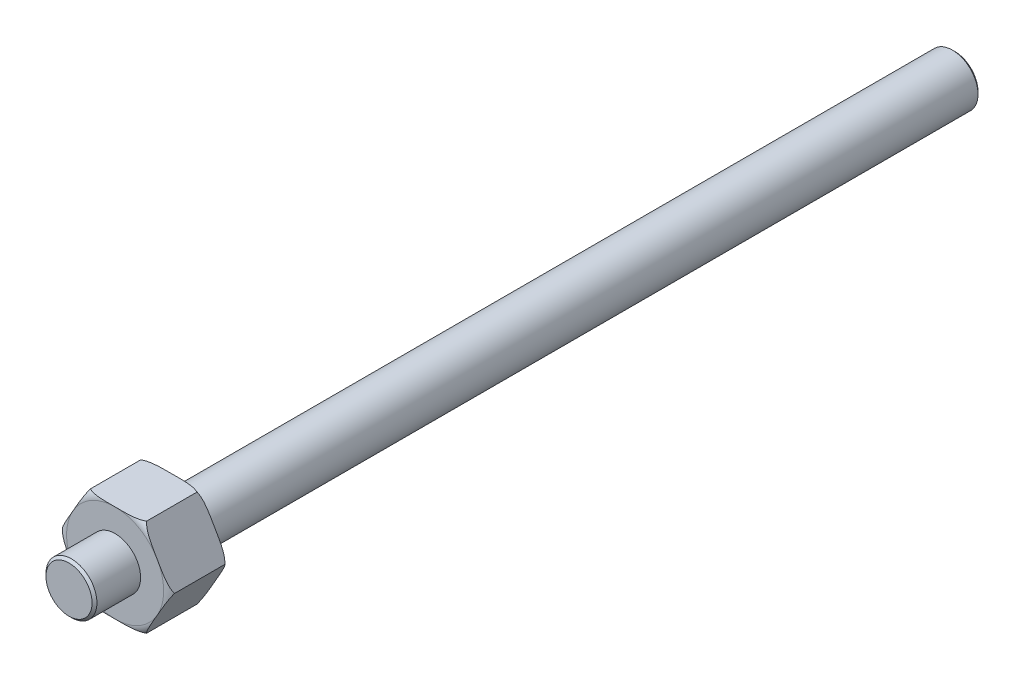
from build123d import *

# Parameters (mm, degrees)
BASE_EXTRUSION_DEPTH = 4.7
ESQUISSE10_R         = 2.1
EXTRUSION2_DEPTH     = 73
CHANFREIN3_SIZE      = 0.2
CHANFREIN4_SIZE      = 0.2


with BuildPart() as part:
    # Esquisse1 → Base-Extrusion (new body)
    with BuildSketch(Plane.XY):
        Polygon((-4.618802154, 0), (-2.309401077, 4), (2.309401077, 4), (4.618802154, 0), (2.309401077, -4), (-2.309401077, -4), align=None)
    extrude(amount=BASE_EXTRUSION_DEPTH)

    # Esquisse3 → Enlever de la mati_re-R_volution1 (revolve, cut)
    with BuildSketch(Plane(origin=(0, 0, 0), x_dir=(1, 0, 0), z_dir=(0, 1, 0))):
        with BuildLine():
            Line((-4.618802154, -0.275186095), (-4.618802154, 0))
            Line((-4.618802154, 0), (-4, 0))
            ThreePointArc((-4, 0), (-4.338616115, -0.071898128), (-4.618802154, -0.275186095))
        make_face()
    enlever_de_la_mati_re_r_volution1 = revolve(axis=Axis((0, 0, 0), (0, 0, 1)), mode=Mode.SUBTRACT)

    # Sym_trie1: Enlever de la mati_re-R_volution1 across plane
    add(enlever_de_la_mati_re_r_volution1.mirror(Plane(origin=(0, 0, 2.35), x_dir=(1, 0, 0), z_dir=(0, 0, -1))), mode=Mode.SUBTRACT)

    # Esquisse10 → Extrusion2 (add)
    with BuildSketch(Plane.XY.offset(8.5)):
        Circle(ESQUISSE10_R)
    extrude(amount=-EXTRUSION2_DEPTH)

    # Chanfrein3
    chanfrein3_edges = [part.edges().sort_by_distance(p)[0] for p in [
        (-2.1, 0, 8.5),
    ]]
    chamfer(chanfrein3_edges, length=CHANFREIN3_SIZE)

    # Chanfrein4
    chanfrein4_edges = [part.edges().sort_by_distance(p)[0] for p in [
        (-2.1, 0, -64.5),
    ]]
    chamfer(chanfrein4_edges, length=CHANFREIN4_SIZE)


solid = part.part
